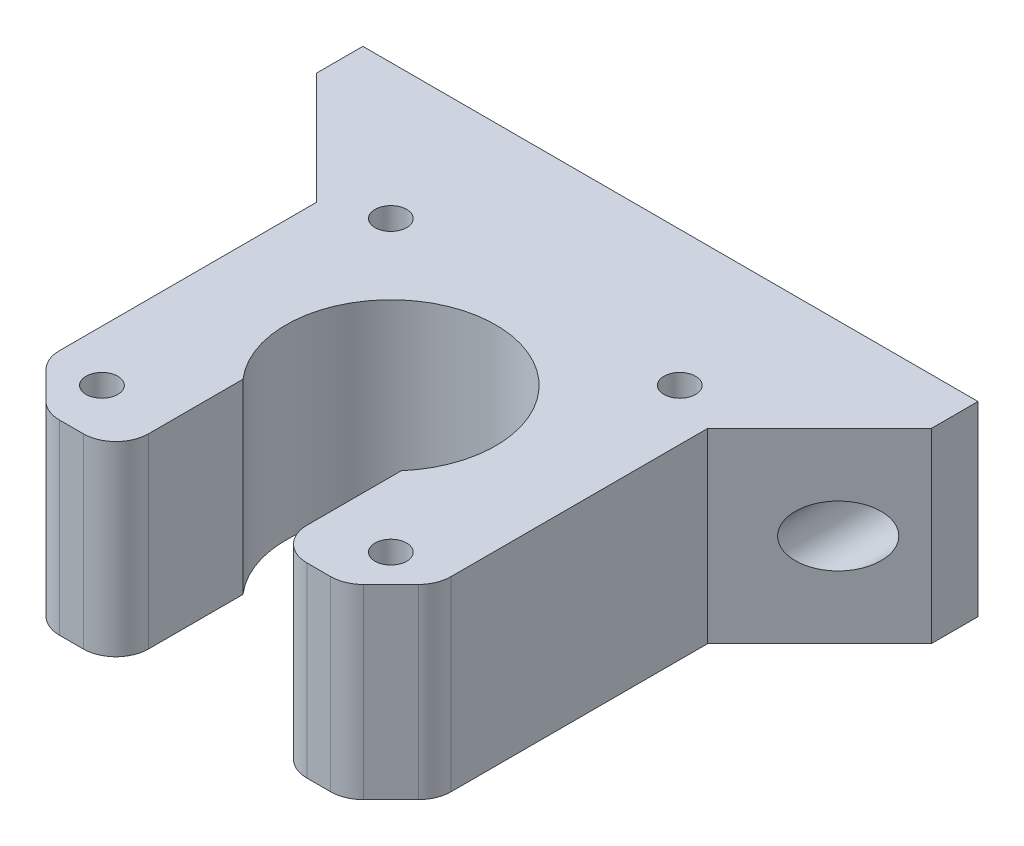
ISO-10303-21;
HEADER;
FILE_DESCRIPTION(('STEP AP214'),'2;1');
FILE_NAME('part.step','',(''),(''),'','','');
FILE_SCHEMA(('AUTOMOTIVE_DESIGN { 1 0 10303 214 1 1 1 1 }'));
ENDSEC;
DATA;
#1=APPLICATION_CONTEXT('core data for automotive mechanical design processes');
#2=APPLICATION_PROTOCOL_DEFINITION('international standard','automotive_design',2000,#1);
#3=PRODUCT_CONTEXT('',#1,'mechanical');
#4=PRODUCT('Part','Part','',(#3));
#5=PRODUCT_RELATED_PRODUCT_CATEGORY('part','',(#4));
#6=PRODUCT_DEFINITION_FORMATION('','',#4);
#7=PRODUCT_DEFINITION_CONTEXT('part definition',#1,'design');
#8=PRODUCT_DEFINITION('design','',#6,#7);
#9=PRODUCT_DEFINITION_SHAPE('','',#8);
#10=(LENGTH_UNIT() NAMED_UNIT(*) SI_UNIT(.MILLI.,.METRE.));
#11=(NAMED_UNIT(*) PLANE_ANGLE_UNIT() SI_UNIT($,.RADIAN.));
#12=(NAMED_UNIT(*) SI_UNIT($,.STERADIAN.) SOLID_ANGLE_UNIT());
#13=UNCERTAINTY_MEASURE_WITH_UNIT(LENGTH_MEASURE(1.E-05),#10,'distance_accuracy_value','');
#14=(GEOMETRIC_REPRESENTATION_CONTEXT(3) GLOBAL_UNCERTAINTY_ASSIGNED_CONTEXT((#13)) GLOBAL_UNIT_ASSIGNED_CONTEXT((#10,
#11,#12)) REPRESENTATION_CONTEXT('',''));
#15=CARTESIAN_POINT('',(0.,0.,0.));
#16=DIRECTION('',(0.,0.,1.));
#17=DIRECTION('',(1.,0.,0.));
#18=AXIS2_PLACEMENT_3D('',#15,#16,#17);
#19=CARTESIAN_POINT('',(21.,10.,21.));
#20=DIRECTION('',(-1.,0.,0.));
#21=DIRECTION('',(0.,0.,1.));
#22=AXIS2_PLACEMENT_3D('',#19,#20,#21);
#23=PLANE('',#22);
#24=DIRECTION('',(0.,0.,-1.));
#25=VECTOR('',#24,1.);
#26=CARTESIAN_POINT('',(21.,-10.,21.));
#27=LINE('',#26,#25);
#28=CARTESIAN_POINT('',(21.,-10.,14.5502525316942));
#29=VERTEX_POINT('',#28);
#30=CARTESIAN_POINT('',(21.,-10.,-12.9999999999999));
#31=VERTEX_POINT('',#30);
#32=EDGE_CURVE('E346',#29,#31,#27,.T.);
#33=ORIENTED_EDGE('',*,*,#32,.T.);
#34=DIRECTION('',(0.,1.,0.));
#35=VECTOR('',#34,1.);
#36=CARTESIAN_POINT('',(21.,-30.8086520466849,-12.9999999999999));
#37=LINE('',#36,#35);
#38=CARTESIAN_POINT('',(21.,10.,-12.9999999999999));
#39=VERTEX_POINT('',#38);
#40=EDGE_CURVE('E531',#31,#39,#37,.T.);
#41=ORIENTED_EDGE('',*,*,#40,.T.);
#42=DIRECTION('',(0.,0.,-1.));
#43=VECTOR('',#42,1.);
#44=CARTESIAN_POINT('',(21.,10.,21.));
#45=LINE('',#44,#43);
#46=CARTESIAN_POINT('',(21.,10.,14.5502525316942));
#47=VERTEX_POINT('',#46);
#48=EDGE_CURVE('E350',#47,#39,#45,.T.);
#49=ORIENTED_EDGE('',*,*,#48,.F.);
#50=DIRECTION('',(0.,1.,0.));
#51=VECTOR('',#50,1.);
#52=CARTESIAN_POINT('',(21.,-10.,14.5502525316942));
#53=LINE('',#52,#51);
#54=EDGE_CURVE('E448',#47,#29,#53,.F.);
#55=ORIENTED_EDGE('',*,*,#54,.T.);
#56=EDGE_LOOP('',(#33,#41,#49,#55));
#57=FACE_BOUND('',#56,.T.);
#58=ADVANCED_FACE('F46',(#57),#23,.F.);
#59=CARTESIAN_POINT('',(-21.,10.,21.));
#60=DIRECTION('',(0.,0.,-1.));
#61=DIRECTION('',(-1.,0.,0.));
#62=AXIS2_PLACEMENT_3D('',#59,#60,#61);
#63=PLANE('',#62);
#64=DIRECTION('',(1.,0.,0.));
#65=VECTOR('',#64,1.);
#66=CARTESIAN_POINT('',(-21.,-10.,21.));
#67=LINE('',#66,#65);
#68=CARTESIAN_POINT('',(-14.5502525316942,-10.,21.));
#69=VERTEX_POINT('',#68);
#70=CARTESIAN_POINT('',(-12.,-10.,21.));
#71=VERTEX_POINT('',#70);
#72=EDGE_CURVE('E355',#69,#71,#67,.T.);
#73=ORIENTED_EDGE('',*,*,#72,.T.);
#74=DIRECTION('',(0.,1.,0.));
#75=VECTOR('',#74,1.);
#76=CARTESIAN_POINT('',(-12.,10.,21.));
#77=LINE('',#76,#75);
#78=CARTESIAN_POINT('',(-12.,10.,21.));
#79=VERTEX_POINT('',#78);
#80=EDGE_CURVE('E441',#71,#79,#77,.T.);
#81=ORIENTED_EDGE('',*,*,#80,.T.);
#82=DIRECTION('',(1.,0.,0.));
#83=VECTOR('',#82,1.);
#84=CARTESIAN_POINT('',(-21.,10.,21.));
#85=LINE('',#84,#83);
#86=CARTESIAN_POINT('',(-14.5502525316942,10.,21.));
#87=VERTEX_POINT('',#86);
#88=EDGE_CURVE('E362',#87,#79,#85,.T.);
#89=ORIENTED_EDGE('',*,*,#88,.F.);
#90=DIRECTION('',(0.,1.,0.));
#91=VECTOR('',#90,1.);
#92=CARTESIAN_POINT('',(-14.5502525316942,-10.,21.));
#93=LINE('',#92,#91);
#94=EDGE_CURVE('E437',#87,#69,#93,.F.);
#95=ORIENTED_EDGE('',*,*,#94,.T.);
#96=EDGE_LOOP('',(#73,#81,#89,#95));
#97=FACE_BOUND('',#96,.T.);
#98=ADVANCED_FACE('F594',(#97),#63,.F.);
#99=CARTESIAN_POINT('',(-21.,10.,21.));
#100=DIRECTION('',(1.,0.,0.));
#101=DIRECTION('',(0.,0.,-1.));
#102=AXIS2_PLACEMENT_3D('',#99,#100,#101);
#103=PLANE('',#102);
#104=DIRECTION('',(0.,0.,1.));
#105=VECTOR('',#104,1.);
#106=CARTESIAN_POINT('',(-21.,10.,21.));
#107=LINE('',#106,#105);
#108=CARTESIAN_POINT('',(-21.,10.,-12.9999999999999));
#109=VERTEX_POINT('',#108);
#110=CARTESIAN_POINT('',(-21.,10.,14.5502525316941));
#111=VERTEX_POINT('',#110);
#112=EDGE_CURVE('E354',#109,#111,#107,.T.);
#113=ORIENTED_EDGE('',*,*,#112,.F.);
#114=DIRECTION('',(0.,1.,0.));
#115=VECTOR('',#114,1.);
#116=CARTESIAN_POINT('',(-21.,-30.8086520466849,-12.9999999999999));
#117=LINE('',#116,#115);
#118=CARTESIAN_POINT('',(-21.,-10.,-12.9999999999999));
#119=VERTEX_POINT('',#118);
#120=EDGE_CURVE('E249',#119,#109,#117,.T.);
#121=ORIENTED_EDGE('',*,*,#120,.F.);
#122=DIRECTION('',(0.,0.,1.));
#123=VECTOR('',#122,1.);
#124=CARTESIAN_POINT('',(-21.,-10.,21.));
#125=LINE('',#124,#123);
#126=CARTESIAN_POINT('',(-21.,-10.,14.5502525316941));
#127=VERTEX_POINT('',#126);
#128=EDGE_CURVE('E366',#119,#127,#125,.T.);
#129=ORIENTED_EDGE('',*,*,#128,.T.);
#130=DIRECTION('',(0.,-1.,0.));
#131=VECTOR('',#130,1.);
#132=CARTESIAN_POINT('',(-21.,10.,14.5502525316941));
#133=LINE('',#132,#131);
#134=EDGE_CURVE('E11',#127,#111,#133,.F.);
#135=ORIENTED_EDGE('',*,*,#134,.T.);
#136=EDGE_LOOP('',(#113,#121,#129,#135));
#137=FACE_BOUND('',#136,.T.);
#138=ADVANCED_FACE('F573',(#137),#103,.F.);
#139=CARTESIAN_POINT('',(12.,10.,21.));
#140=VERTEX_POINT('',#139);
#141=CARTESIAN_POINT('',(14.5502525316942,10.,21.));
#142=VERTEX_POINT('',#141);
#143=EDGE_CURVE('E358',#140,#142,#85,.T.);
#144=ORIENTED_EDGE('',*,*,#143,.F.);
#145=DIRECTION('',(0.,1.,0.));
#146=VECTOR('',#145,1.);
#147=CARTESIAN_POINT('',(12.,10.,21.));
#148=LINE('',#147,#146);
#149=CARTESIAN_POINT('',(12.,-10.,21.));
#150=VERTEX_POINT('',#149);
#151=EDGE_CURVE('E415',#140,#150,#148,.F.);
#152=ORIENTED_EDGE('',*,*,#151,.T.);
#153=CARTESIAN_POINT('',(14.5502525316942,-10.,21.));
#154=VERTEX_POINT('',#153);
#155=EDGE_CURVE('E369',#150,#154,#67,.T.);
#156=ORIENTED_EDGE('',*,*,#155,.T.);
#157=DIRECTION('',(0.,-1.,0.));
#158=VECTOR('',#157,1.);
#159=CARTESIAN_POINT('',(14.5502525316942,10.,21.));
#160=LINE('',#159,#158);
#161=EDGE_CURVE('E411',#154,#142,#160,.F.);
#162=ORIENTED_EDGE('',*,*,#161,.T.);
#163=EDGE_LOOP('',(#144,#152,#156,#162));
#164=FACE_BOUND('',#163,.T.);
#165=ADVANCED_FACE('F671',(#164),#63,.F.);
#166=CARTESIAN_POINT('',(0.,10.,0.));
#167=DIRECTION('',(0.,-1.,0.));
#168=DIRECTION('',(0.,0.,-1.));
#169=AXIS2_PLACEMENT_3D('',#166,#167,#168);
#170=PLANE('',#169);
#171=CARTESIAN_POINT('',(-15.5,10.,15.5));
#172=DIRECTION('',(0.,-1.,0.));
#173=DIRECTION('',(0.,0.,-1.));
#174=AXIS2_PLACEMENT_3D('',#171,#172,#173);
#175=CIRCLE('',#174,1.69999999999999);
#176=CARTESIAN_POINT('',(-15.5,10.,13.8));
#177=VERTEX_POINT('',#176);
#178=EDGE_CURVE('E268',#177,#177,#175,.T.);
#179=ORIENTED_EDGE('',*,*,#178,.T.);
#180=EDGE_LOOP('',(#179));
#181=FACE_BOUND('',#180,.T.);
#182=CARTESIAN_POINT('',(-15.5,10.,-15.5));
#183=DIRECTION('',(0.,-1.,0.));
#184=DIRECTION('',(0.,0.,-1.));
#185=AXIS2_PLACEMENT_3D('',#182,#183,#184);
#186=CIRCLE('',#185,1.69999999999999);
#187=CARTESIAN_POINT('',(-15.5,10.,-17.2));
#188=VERTEX_POINT('',#187);
#189=EDGE_CURVE('E284',#188,#188,#186,.T.);
#190=ORIENTED_EDGE('',*,*,#189,.T.);
#191=EDGE_LOOP('',(#190));
#192=FACE_BOUND('',#191,.T.);
#193=CARTESIAN_POINT('',(15.5,10.,-15.5));
#194=DIRECTION('',(0.,-1.,0.));
#195=DIRECTION('',(0.,0.,-1.));
#196=AXIS2_PLACEMENT_3D('',#193,#194,#195);
#197=CIRCLE('',#196,1.69999999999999);
#198=CARTESIAN_POINT('',(15.5,10.,-17.2));
#199=VERTEX_POINT('',#198);
#200=EDGE_CURVE('E300',#199,#199,#197,.T.);
#201=ORIENTED_EDGE('',*,*,#200,.T.);
#202=EDGE_LOOP('',(#201));
#203=FACE_BOUND('',#202,.T.);
#204=CARTESIAN_POINT('',(15.5,10.,15.5));
#205=DIRECTION('',(0.,-1.,0.));
#206=DIRECTION('',(0.,0.,-1.));
#207=AXIS2_PLACEMENT_3D('',#204,#205,#206);
#208=CIRCLE('',#207,1.69999999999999);
#209=CARTESIAN_POINT('',(15.5,10.,13.8));
#210=VERTEX_POINT('',#209);
#211=EDGE_CURVE('E316',#210,#210,#208,.T.);
#212=ORIENTED_EDGE('',*,*,#211,.T.);
#213=EDGE_LOOP('',(#212));
#214=FACE_BOUND('',#213,.T.);
#215=DIRECTION('',(0.,0.,-1.));
#216=VECTOR('',#215,1.);
#217=CARTESIAN_POINT('',(8.5,10.,21.));
#218=LINE('',#217,#216);
#219=CARTESIAN_POINT('',(8.5,10.,17.5));
#220=VERTEX_POINT('',#219);
#221=CARTESIAN_POINT('',(8.5,10.,7.36970148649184));
#222=VERTEX_POINT('',#221);
#223=EDGE_CURVE('E337',#220,#222,#218,.T.);
#224=ORIENTED_EDGE('',*,*,#223,.F.);
#225=CARTESIAN_POINT('',(12.,10.,17.5));
#226=DIRECTION('',(0.,-1.,0.));
#227=DIRECTION('',(0.,0.,-1.));
#228=AXIS2_PLACEMENT_3D('',#225,#226,#227);
#229=CIRCLE('',#228,3.5);
#230=EDGE_CURVE('E408',#220,#140,#229,.F.);
#231=ORIENTED_EDGE('',*,*,#230,.T.);
#232=ORIENTED_EDGE('',*,*,#143,.T.);
#233=CARTESIAN_POINT('',(14.5502525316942,10.,17.5));
#234=DIRECTION('',(0.,-1.,0.));
#235=DIRECTION('',(0.,0.,-1.));
#236=AXIS2_PLACEMENT_3D('',#233,#234,#235);
#237=CIRCLE('',#236,3.5);
#238=CARTESIAN_POINT('',(17.0251262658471,10.,19.9748737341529));
#239=VERTEX_POINT('',#238);
#240=EDGE_CURVE('E399',#142,#239,#237,.F.);
#241=ORIENTED_EDGE('',*,*,#240,.T.);
#242=DIRECTION('',(-0.707106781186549,0.,0.707106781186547));
#243=VECTOR('',#242,1.);
#244=CARTESIAN_POINT('',(21.,10.,16.));
#245=LINE('',#244,#243);
#246=CARTESIAN_POINT('',(19.9748737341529,10.,17.0251262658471));
#247=VERTEX_POINT('',#246);
#248=EDGE_CURVE('E381',#239,#247,#245,.F.);
#249=ORIENTED_EDGE('',*,*,#248,.T.);
#250=CARTESIAN_POINT('',(17.5,10.,14.5502525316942));
#251=DIRECTION('',(0.,-1.,0.));
#252=DIRECTION('',(0.,0.,-1.));
#253=AXIS2_PLACEMENT_3D('',#250,#251,#252);
#254=CIRCLE('',#253,3.5);
#255=EDGE_CURVE('E402',#247,#47,#254,.F.);
#256=ORIENTED_EDGE('',*,*,#255,.T.);
#257=ORIENTED_EDGE('',*,*,#48,.T.);
#258=DIRECTION('',(0.707106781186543,0.,-0.707106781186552));
#259=VECTOR('',#258,1.);
#260=CARTESIAN_POINT('',(33.,10.,-25.));
#261=LINE('',#260,#259);
#262=CARTESIAN_POINT('',(33.,10.,-25.));
#263=VERTEX_POINT('',#262);
#264=EDGE_CURVE('E467',#39,#263,#261,.T.);
#265=ORIENTED_EDGE('',*,*,#264,.T.);
#266=DIRECTION('',(0.,0.,-1.));
#267=VECTOR('',#266,1.);
#268=CARTESIAN_POINT('',(33.,10.,-30.));
#269=LINE('',#268,#267);
#270=CARTESIAN_POINT('',(33.,10.,-30.));
#271=VERTEX_POINT('',#270);
#272=EDGE_CURVE('E511',#263,#271,#269,.T.);
#273=ORIENTED_EDGE('',*,*,#272,.T.);
#274=DIRECTION('',(1.,0.,0.));
#275=VECTOR('',#274,1.);
#276=CARTESIAN_POINT('',(-21.,10.,-30.));
#277=LINE('',#276,#275);
#278=CARTESIAN_POINT('',(-33.,10.,-30.));
#279=VERTEX_POINT('',#278);
#280=EDGE_CURVE('E253',#279,#271,#277,.T.);
#281=ORIENTED_EDGE('',*,*,#280,.F.);
#282=DIRECTION('',(0.,0.,1.));
#283=VECTOR('',#282,1.);
#284=CARTESIAN_POINT('',(-33.,10.,-30.));
#285=LINE('',#284,#283);
#286=CARTESIAN_POINT('',(-33.,10.,-25.));
#287=VERTEX_POINT('',#286);
#288=EDGE_CURVE('E537',#279,#287,#285,.T.);
#289=ORIENTED_EDGE('',*,*,#288,.T.);
#290=DIRECTION('',(0.707106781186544,0.,0.707106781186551));
#291=VECTOR('',#290,1.);
#292=CARTESIAN_POINT('',(-33.,10.,-25.));
#293=LINE('',#292,#291);
#294=EDGE_CURVE('E538',#287,#109,#293,.T.);
#295=ORIENTED_EDGE('',*,*,#294,.T.);
#296=ORIENTED_EDGE('',*,*,#112,.T.);
#297=CARTESIAN_POINT('',(-17.5,10.,14.5502525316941));
#298=DIRECTION('',(0.,-1.,0.));
#299=DIRECTION('',(0.,0.,-1.));
#300=AXIS2_PLACEMENT_3D('',#297,#298,#299);
#301=CIRCLE('',#300,3.5);
#302=CARTESIAN_POINT('',(-19.9748737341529,10.,17.0251262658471));
#303=VERTEX_POINT('',#302);
#304=EDGE_CURVE('E393',#111,#303,#301,.F.);
#305=ORIENTED_EDGE('',*,*,#304,.T.);
#306=DIRECTION('',(-0.707106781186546,0.,-0.707106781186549));
#307=VECTOR('',#306,1.);
#308=CARTESIAN_POINT('',(-16.,10.,21.));
#309=LINE('',#308,#307);
#310=CARTESIAN_POINT('',(-17.0251262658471,10.,19.9748737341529));
#311=VERTEX_POINT('',#310);
#312=EDGE_CURVE('E385',#303,#311,#309,.F.);
#313=ORIENTED_EDGE('',*,*,#312,.T.);
#314=CARTESIAN_POINT('',(-14.5502525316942,10.,17.5));
#315=DIRECTION('',(0.,-1.,0.));
#316=DIRECTION('',(0.,0.,-1.));
#317=AXIS2_PLACEMENT_3D('',#314,#315,#316);
#318=CIRCLE('',#317,3.5);
#319=EDGE_CURVE('E396',#311,#87,#318,.F.);
#320=ORIENTED_EDGE('',*,*,#319,.T.);
#321=ORIENTED_EDGE('',*,*,#88,.T.);
#322=CARTESIAN_POINT('',(-12.,10.,17.5));
#323=DIRECTION('',(0.,-1.,0.));
#324=DIRECTION('',(0.,0.,-1.));
#325=AXIS2_PLACEMENT_3D('',#322,#323,#324);
#326=CIRCLE('',#325,3.5);
#327=CARTESIAN_POINT('',(-8.5,10.,17.5));
#328=VERTEX_POINT('',#327);
#329=EDGE_CURVE('E405',#79,#328,#326,.F.);
#330=ORIENTED_EDGE('',*,*,#329,.T.);
#331=DIRECTION('',(0.,0.,1.));
#332=VECTOR('',#331,1.);
#333=CARTESIAN_POINT('',(-8.5,10.,21.));
#334=LINE('',#333,#332);
#335=CARTESIAN_POINT('',(-8.5,10.,7.36970148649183));
#336=VERTEX_POINT('',#335);
#337=EDGE_CURVE('E320',#336,#328,#334,.T.);
#338=ORIENTED_EDGE('',*,*,#337,.F.);
#339=CARTESIAN_POINT('',(0.,10.,0.));
#340=DIRECTION('',(0.,1.,0.));
#341=DIRECTION('',(0.,0.,1.));
#342=AXIS2_PLACEMENT_3D('',#339,#340,#341);
#343=CIRCLE('',#342,11.25);
#344=EDGE_CURVE('E326',#222,#336,#343,.T.);
#345=ORIENTED_EDGE('',*,*,#344,.F.);
#346=EDGE_LOOP('',(#224,#231,#232,#241,#249,#256,#257,#265,#273,#281,#289,#295,#296,#305,#313,
#320,#321,#330,#338,#345));
#347=FACE_BOUND('',#346,.T.);
#348=ADVANCED_FACE('F566',(#181,#192,#203,#214,#347),#170,.F.);
#349=CARTESIAN_POINT('',(0.,-10.,0.));
#350=DIRECTION('',(0.,-1.,0.));
#351=DIRECTION('',(0.,0.,-1.));
#352=AXIS2_PLACEMENT_3D('',#349,#350,#351);
#353=PLANE('',#352);
#354=CARTESIAN_POINT('',(-15.5,-10.,15.5));
#355=DIRECTION('',(0.,-1.,0.));
#356=DIRECTION('',(0.,0.,-1.));
#357=AXIS2_PLACEMENT_3D('',#354,#355,#356);
#358=CIRCLE('',#357,3.25);
#359=CARTESIAN_POINT('',(-15.5,-10.,12.25));
#360=VERTEX_POINT('',#359);
#361=EDGE_CURVE('E256',#360,#360,#358,.T.);
#362=ORIENTED_EDGE('',*,*,#361,.F.);
#363=EDGE_LOOP('',(#362));
#364=FACE_BOUND('',#363,.T.);
#365=CARTESIAN_POINT('',(-15.5,-10.,-15.5));
#366=DIRECTION('',(0.,-1.,0.));
#367=DIRECTION('',(0.,0.,-1.));
#368=AXIS2_PLACEMENT_3D('',#365,#366,#367);
#369=CIRCLE('',#368,3.25);
#370=CARTESIAN_POINT('',(-15.5,-10.,-18.75));
#371=VERTEX_POINT('',#370);
#372=EDGE_CURVE('E272',#371,#371,#369,.T.);
#373=ORIENTED_EDGE('',*,*,#372,.F.);
#374=EDGE_LOOP('',(#373));
#375=FACE_BOUND('',#374,.T.);
#376=CARTESIAN_POINT('',(15.5,-10.,-15.5));
#377=DIRECTION('',(0.,-1.,0.));
#378=DIRECTION('',(0.,0.,-1.));
#379=AXIS2_PLACEMENT_3D('',#376,#377,#378);
#380=CIRCLE('',#379,3.25);
#381=CARTESIAN_POINT('',(15.5,-10.,-18.75));
#382=VERTEX_POINT('',#381);
#383=EDGE_CURVE('E288',#382,#382,#380,.T.);
#384=ORIENTED_EDGE('',*,*,#383,.F.);
#385=EDGE_LOOP('',(#384));
#386=FACE_BOUND('',#385,.T.);
#387=CARTESIAN_POINT('',(15.5,-10.,15.5));
#388=DIRECTION('',(0.,-1.,0.));
#389=DIRECTION('',(0.,0.,-1.));
#390=AXIS2_PLACEMENT_3D('',#387,#388,#389);
#391=CIRCLE('',#390,3.25);
#392=CARTESIAN_POINT('',(15.5,-10.,12.25));
#393=VERTEX_POINT('',#392);
#394=EDGE_CURVE('E304',#393,#393,#391,.T.);
#395=ORIENTED_EDGE('',*,*,#394,.F.);
#396=EDGE_LOOP('',(#395));
#397=FACE_BOUND('',#396,.T.);
#398=ORIENTED_EDGE('',*,*,#155,.F.);
#399=CARTESIAN_POINT('',(12.,-10.,17.5));
#400=DIRECTION('',(0.,-1.,0.));
#401=DIRECTION('',(0.,0.,-1.));
#402=AXIS2_PLACEMENT_3D('',#399,#400,#401);
#403=CIRCLE('',#402,3.5);
#404=CARTESIAN_POINT('',(8.5,-10.,17.5));
#405=VERTEX_POINT('',#404);
#406=EDGE_CURVE('E434',#150,#405,#403,.T.);
#407=ORIENTED_EDGE('',*,*,#406,.T.);
#408=DIRECTION('',(0.,0.,-1.));
#409=VECTOR('',#408,1.);
#410=CARTESIAN_POINT('',(8.5,-10.,21.));
#411=LINE('',#410,#409);
#412=CARTESIAN_POINT('',(8.5,-10.,7.36970148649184));
#413=VERTEX_POINT('',#412);
#414=EDGE_CURVE('E325',#405,#413,#411,.T.);
#415=ORIENTED_EDGE('',*,*,#414,.T.);
#416=CARTESIAN_POINT('',(0.,-10.,0.));
#417=DIRECTION('',(0.,1.,0.));
#418=DIRECTION('',(0.,0.,1.));
#419=AXIS2_PLACEMENT_3D('',#416,#417,#418);
#420=CIRCLE('',#419,11.25);
#421=CARTESIAN_POINT('',(-8.5,-10.,7.36970148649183));
#422=VERTEX_POINT('',#421);
#423=EDGE_CURVE('E329',#413,#422,#420,.T.);
#424=ORIENTED_EDGE('',*,*,#423,.T.);
#425=DIRECTION('',(0.,0.,1.));
#426=VECTOR('',#425,1.);
#427=CARTESIAN_POINT('',(-8.5,-10.,21.));
#428=LINE('',#427,#426);
#429=CARTESIAN_POINT('',(-8.5,-10.,17.5));
#430=VERTEX_POINT('',#429);
#431=EDGE_CURVE('E321',#422,#430,#428,.T.);
#432=ORIENTED_EDGE('',*,*,#431,.T.);
#433=CARTESIAN_POINT('',(-12.,-10.,17.5));
#434=DIRECTION('',(0.,-1.,0.));
#435=DIRECTION('',(0.,0.,-1.));
#436=AXIS2_PLACEMENT_3D('',#433,#434,#435);
#437=CIRCLE('',#436,3.5);
#438=EDGE_CURVE('E431',#430,#71,#437,.T.);
#439=ORIENTED_EDGE('',*,*,#438,.T.);
#440=ORIENTED_EDGE('',*,*,#72,.F.);
#441=CARTESIAN_POINT('',(-14.5502525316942,-10.,17.5));
#442=DIRECTION('',(0.,-1.,0.));
#443=DIRECTION('',(0.,0.,-1.));
#444=AXIS2_PLACEMENT_3D('',#441,#442,#443);
#445=CIRCLE('',#444,3.5);
#446=CARTESIAN_POINT('',(-17.0251262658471,-10.,19.9748737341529));
#447=VERTEX_POINT('',#446);
#448=EDGE_CURVE('E422',#69,#447,#445,.T.);
#449=ORIENTED_EDGE('',*,*,#448,.T.);
#450=DIRECTION('',(0.707106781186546,0.,0.707106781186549));
#451=VECTOR('',#450,1.);
#452=CARTESIAN_POINT('',(-18.5,-10.,18.5));
#453=LINE('',#452,#451);
#454=CARTESIAN_POINT('',(-19.9748737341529,-10.,17.0251262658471));
#455=VERTEX_POINT('',#454);
#456=EDGE_CURVE('E377',#447,#455,#453,.F.);
#457=ORIENTED_EDGE('',*,*,#456,.T.);
#458=CARTESIAN_POINT('',(-17.5,-10.,14.5502525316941));
#459=DIRECTION('',(0.,-1.,0.));
#460=DIRECTION('',(0.,0.,-1.));
#461=AXIS2_PLACEMENT_3D('',#458,#459,#460);
#462=CIRCLE('',#461,3.5);
#463=EDGE_CURVE('E418',#455,#127,#462,.T.);
#464=ORIENTED_EDGE('',*,*,#463,.T.);
#465=ORIENTED_EDGE('',*,*,#128,.F.);
#466=DIRECTION('',(0.707106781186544,0.,0.707106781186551));
#467=VECTOR('',#466,1.);
#468=CARTESIAN_POINT('',(-33.,-10.,-25.));
#469=LINE('',#468,#467);
#470=CARTESIAN_POINT('',(-33.,-10.,-25.));
#471=VERTEX_POINT('',#470);
#472=EDGE_CURVE('E545',#471,#119,#469,.T.);
#473=ORIENTED_EDGE('',*,*,#472,.F.);
#474=DIRECTION('',(0.,0.,1.));
#475=VECTOR('',#474,1.);
#476=CARTESIAN_POINT('',(-33.,-10.,-30.));
#477=LINE('',#476,#475);
#478=CARTESIAN_POINT('',(-33.,-10.,-30.));
#479=VERTEX_POINT('',#478);
#480=EDGE_CURVE('E549',#479,#471,#477,.T.);
#481=ORIENTED_EDGE('',*,*,#480,.F.);
#482=DIRECTION('',(-1.,0.,0.));
#483=VECTOR('',#482,1.);
#484=CARTESIAN_POINT('',(21.,-10.,-30.));
#485=LINE('',#484,#483);
#486=CARTESIAN_POINT('',(33.,-10.,-30.));
#487=VERTEX_POINT('',#486);
#488=EDGE_CURVE('E240',#487,#479,#485,.T.);
#489=ORIENTED_EDGE('',*,*,#488,.F.);
#490=DIRECTION('',(0.,0.,-1.));
#491=VECTOR('',#490,1.);
#492=CARTESIAN_POINT('',(33.,-10.,-30.));
#493=LINE('',#492,#491);
#494=CARTESIAN_POINT('',(33.,-10.,-25.));
#495=VERTEX_POINT('',#494);
#496=EDGE_CURVE('E523',#495,#487,#493,.T.);
#497=ORIENTED_EDGE('',*,*,#496,.F.);
#498=DIRECTION('',(0.707106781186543,0.,-0.707106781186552));
#499=VECTOR('',#498,1.);
#500=CARTESIAN_POINT('',(33.,-10.,-25.));
#501=LINE('',#500,#499);
#502=EDGE_CURVE('E515',#31,#495,#501,.T.);
#503=ORIENTED_EDGE('',*,*,#502,.F.);
#504=ORIENTED_EDGE('',*,*,#32,.F.);
#505=CARTESIAN_POINT('',(17.5,-10.,14.5502525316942));
#506=DIRECTION('',(0.,-1.,0.));
#507=DIRECTION('',(0.,0.,-1.));
#508=AXIS2_PLACEMENT_3D('',#505,#506,#507);
#509=CIRCLE('',#508,3.5);
#510=CARTESIAN_POINT('',(19.9748737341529,-10.,17.0251262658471));
#511=VERTEX_POINT('',#510);
#512=EDGE_CURVE('E428',#29,#511,#509,.T.);
#513=ORIENTED_EDGE('',*,*,#512,.T.);
#514=DIRECTION('',(0.707106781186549,0.,-0.707106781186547));
#515=VECTOR('',#514,1.);
#516=CARTESIAN_POINT('',(18.5,-10.,18.5));
#517=LINE('',#516,#515);
#518=CARTESIAN_POINT('',(17.0251262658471,-10.,19.9748737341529));
#519=VERTEX_POINT('',#518);
#520=EDGE_CURVE('E373',#511,#519,#517,.F.);
#521=ORIENTED_EDGE('',*,*,#520,.T.);
#522=CARTESIAN_POINT('',(14.5502525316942,-10.,17.5));
#523=DIRECTION('',(0.,-1.,0.));
#524=DIRECTION('',(0.,0.,-1.));
#525=AXIS2_PLACEMENT_3D('',#522,#523,#524);
#526=CIRCLE('',#525,3.5);
#527=EDGE_CURVE('E425',#519,#154,#526,.T.);
#528=ORIENTED_EDGE('',*,*,#527,.T.);
#529=EDGE_LOOP('',(#398,#407,#415,#424,#432,#439,#440,#449,#457,#464,#465,#473,#481,#489,#497,
#503,#504,#513,#521,#528));
#530=FACE_BOUND('',#529,.T.);
#531=ADVANCED_FACE('F576',(#364,#375,#386,#397,#530),#353,.T.);
#532=CARTESIAN_POINT('',(-8.5,-10.,21.));
#533=DIRECTION('',(-1.,0.,0.));
#534=DIRECTION('',(0.,0.,1.));
#535=AXIS2_PLACEMENT_3D('',#532,#533,#534);
#536=PLANE('',#535);
#537=ORIENTED_EDGE('',*,*,#337,.T.);
#538=DIRECTION('',(0.,1.,0.));
#539=VECTOR('',#538,1.);
#540=CARTESIAN_POINT('',(-8.5,-10.,17.5));
#541=LINE('',#540,#539);
#542=EDGE_CURVE('E445',#328,#430,#541,.F.);
#543=ORIENTED_EDGE('',*,*,#542,.T.);
#544=ORIENTED_EDGE('',*,*,#431,.F.);
#545=DIRECTION('',(0.,1.,0.));
#546=VECTOR('',#545,1.);
#547=CARTESIAN_POINT('',(-8.5,-10.,7.36970148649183));
#548=LINE('',#547,#546);
#549=EDGE_CURVE('E343',#422,#336,#548,.T.);
#550=ORIENTED_EDGE('',*,*,#549,.T.);
#551=EDGE_LOOP('',(#537,#543,#544,#550));
#552=FACE_BOUND('',#551,.T.);
#553=ADVANCED_FACE('F935',(#552),#536,.F.);
#554=CARTESIAN_POINT('',(0.,-10.,0.));
#555=DIRECTION('',(0.,1.,0.));
#556=DIRECTION('',(0.,0.,1.));
#557=AXIS2_PLACEMENT_3D('',#554,#555,#556);
#558=CYLINDRICAL_SURFACE('',#557,11.25);
#559=ORIENTED_EDGE('',*,*,#344,.T.);
#560=ORIENTED_EDGE('',*,*,#549,.F.);
#561=ORIENTED_EDGE('',*,*,#423,.F.);
#562=DIRECTION('',(0.,1.,0.));
#563=VECTOR('',#562,1.);
#564=CARTESIAN_POINT('',(8.5,-10.,7.36970148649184));
#565=LINE('',#564,#563);
#566=EDGE_CURVE('E333',#413,#222,#565,.T.);
#567=ORIENTED_EDGE('',*,*,#566,.T.);
#568=EDGE_LOOP('',(#559,#560,#561,#567));
#569=FACE_BOUND('',#568,.T.);
#570=ADVANCED_FACE('F1038',(#569),#558,.F.);
#571=CARTESIAN_POINT('',(8.5,-10.,21.));
#572=DIRECTION('',(1.,0.,0.));
#573=DIRECTION('',(0.,0.,-1.));
#574=AXIS2_PLACEMENT_3D('',#571,#572,#573);
#575=PLANE('',#574);
#576=ORIENTED_EDGE('',*,*,#414,.F.);
#577=DIRECTION('',(0.,1.,0.));
#578=VECTOR('',#577,1.);
#579=CARTESIAN_POINT('',(8.5,-10.,17.5));
#580=LINE('',#579,#578);
#581=EDGE_CURVE('E389',#405,#220,#580,.T.);
#582=ORIENTED_EDGE('',*,*,#581,.T.);
#583=ORIENTED_EDGE('',*,*,#223,.T.);
#584=ORIENTED_EDGE('',*,*,#566,.F.);
#585=EDGE_LOOP('',(#576,#582,#583,#584));
#586=FACE_BOUND('',#585,.T.);
#587=ADVANCED_FACE('F1031',(#586),#575,.F.);
#588=CARTESIAN_POINT('',(15.5,-10.,15.5));
#589=DIRECTION('',(0.,-1.,0.));
#590=DIRECTION('',(0.,0.,-1.));
#591=AXIS2_PLACEMENT_3D('',#588,#589,#590);
#592=CYLINDRICAL_SURFACE('',#591,1.7);
#593=ORIENTED_EDGE('',*,*,#211,.F.);
#594=EDGE_LOOP('',(#593));
#595=FACE_BOUND('',#594,.T.);
#596=CARTESIAN_POINT('',(15.5,-6.6,15.5));
#597=DIRECTION('',(0.,-1.,0.));
#598=DIRECTION('',(0.,0.,-1.));
#599=AXIS2_PLACEMENT_3D('',#596,#597,#598);
#600=CIRCLE('',#599,1.7);
#601=CARTESIAN_POINT('',(15.5,-6.6,13.8));
#602=VERTEX_POINT('',#601);
#603=EDGE_CURVE('E312',#602,#602,#600,.T.);
#604=ORIENTED_EDGE('',*,*,#603,.T.);
#605=EDGE_LOOP('',(#604));
#606=FACE_BOUND('',#605,.T.);
#607=ADVANCED_FACE('F1037',(#595,#606),#592,.F.);
#608=CARTESIAN_POINT('',(17.2,-6.6,15.5));
#609=DIRECTION('',(0.,1.,0.));
#610=DIRECTION('',(0.,0.,1.));
#611=AXIS2_PLACEMENT_3D('',#608,#609,#610);
#612=PLANE('',#611);
#613=ORIENTED_EDGE('',*,*,#603,.F.);
#614=EDGE_LOOP('',(#613));
#615=FACE_BOUND('',#614,.T.);
#616=CARTESIAN_POINT('',(15.5,-6.6,15.5));
#617=DIRECTION('',(0.,-1.,0.));
#618=DIRECTION('',(0.,0.,-1.));
#619=AXIS2_PLACEMENT_3D('',#616,#617,#618);
#620=CIRCLE('',#619,3.25);
#621=CARTESIAN_POINT('',(15.5,-6.6,12.25));
#622=VERTEX_POINT('',#621);
#623=EDGE_CURVE('E308',#622,#622,#620,.T.);
#624=ORIENTED_EDGE('',*,*,#623,.T.);
#625=EDGE_LOOP('',(#624));
#626=FACE_BOUND('',#625,.T.);
#627=ADVANCED_FACE('F1173',(#615,#626),#612,.F.);
#628=CARTESIAN_POINT('',(15.5,-10.,15.5));
#629=DIRECTION('',(0.,-1.,0.));
#630=DIRECTION('',(0.,0.,-1.));
#631=AXIS2_PLACEMENT_3D('',#628,#629,#630);
#632=CYLINDRICAL_SURFACE('',#631,3.25);
#633=ORIENTED_EDGE('',*,*,#623,.F.);
#634=EDGE_LOOP('',(#633));
#635=FACE_BOUND('',#634,.T.);
#636=ORIENTED_EDGE('',*,*,#394,.T.);
#637=EDGE_LOOP('',(#636));
#638=FACE_BOUND('',#637,.T.);
#639=ADVANCED_FACE('F1162',(#635,#638),#632,.F.);
#640=CARTESIAN_POINT('',(15.5,-10.,-15.5));
#641=DIRECTION('',(0.,-1.,0.));
#642=DIRECTION('',(0.,0.,-1.));
#643=AXIS2_PLACEMENT_3D('',#640,#641,#642);
#644=CYLINDRICAL_SURFACE('',#643,1.7);
#645=ORIENTED_EDGE('',*,*,#200,.F.);
#646=EDGE_LOOP('',(#645));
#647=FACE_BOUND('',#646,.T.);
#648=CARTESIAN_POINT('',(15.5,-6.6,-15.5));
#649=DIRECTION('',(0.,-1.,0.));
#650=DIRECTION('',(0.,0.,-1.));
#651=AXIS2_PLACEMENT_3D('',#648,#649,#650);
#652=CIRCLE('',#651,1.7);
#653=CARTESIAN_POINT('',(15.5,-6.6,-17.2));
#654=VERTEX_POINT('',#653);
#655=EDGE_CURVE('E296',#654,#654,#652,.T.);
#656=ORIENTED_EDGE('',*,*,#655,.T.);
#657=EDGE_LOOP('',(#656));
#658=FACE_BOUND('',#657,.T.);
#659=ADVANCED_FACE('F1151',(#647,#658),#644,.F.);
#660=CARTESIAN_POINT('',(17.2,-6.6,-15.5));
#661=DIRECTION('',(0.,1.,0.));
#662=DIRECTION('',(0.,0.,1.));
#663=AXIS2_PLACEMENT_3D('',#660,#661,#662);
#664=PLANE('',#663);
#665=ORIENTED_EDGE('',*,*,#655,.F.);
#666=EDGE_LOOP('',(#665));
#667=FACE_BOUND('',#666,.T.);
#668=CARTESIAN_POINT('',(15.5,-6.6,-15.5));
#669=DIRECTION('',(0.,-1.,0.));
#670=DIRECTION('',(0.,0.,-1.));
#671=AXIS2_PLACEMENT_3D('',#668,#669,#670);
#672=CIRCLE('',#671,3.25);
#673=CARTESIAN_POINT('',(15.5,-6.6,-18.75));
#674=VERTEX_POINT('',#673);
#675=EDGE_CURVE('E292',#674,#674,#672,.T.);
#676=ORIENTED_EDGE('',*,*,#675,.T.);
#677=EDGE_LOOP('',(#676));
#678=FACE_BOUND('',#677,.T.);
#679=ADVANCED_FACE('F1140',(#667,#678),#664,.F.);
#680=CARTESIAN_POINT('',(15.5,-10.,-15.5));
#681=DIRECTION('',(0.,-1.,0.));
#682=DIRECTION('',(0.,0.,-1.));
#683=AXIS2_PLACEMENT_3D('',#680,#681,#682);
#684=CYLINDRICAL_SURFACE('',#683,3.25);
#685=ORIENTED_EDGE('',*,*,#675,.F.);
#686=EDGE_LOOP('',(#685));
#687=FACE_BOUND('',#686,.T.);
#688=ORIENTED_EDGE('',*,*,#383,.T.);
#689=EDGE_LOOP('',(#688));
#690=FACE_BOUND('',#689,.T.);
#691=ADVANCED_FACE('F1129',(#687,#690),#684,.F.);
#692=CARTESIAN_POINT('',(-15.5,-10.,-15.5));
#693=DIRECTION('',(0.,-1.,0.));
#694=DIRECTION('',(0.,0.,-1.));
#695=AXIS2_PLACEMENT_3D('',#692,#693,#694);
#696=CYLINDRICAL_SURFACE('',#695,1.7);
#697=ORIENTED_EDGE('',*,*,#189,.F.);
#698=EDGE_LOOP('',(#697));
#699=FACE_BOUND('',#698,.T.);
#700=CARTESIAN_POINT('',(-15.5,-6.6,-15.5));
#701=DIRECTION('',(0.,-1.,0.));
#702=DIRECTION('',(0.,0.,-1.));
#703=AXIS2_PLACEMENT_3D('',#700,#701,#702);
#704=CIRCLE('',#703,1.7);
#705=CARTESIAN_POINT('',(-15.5,-6.6,-17.2));
#706=VERTEX_POINT('',#705);
#707=EDGE_CURVE('E280',#706,#706,#704,.T.);
#708=ORIENTED_EDGE('',*,*,#707,.T.);
#709=EDGE_LOOP('',(#708));
#710=FACE_BOUND('',#709,.T.);
#711=ADVANCED_FACE('F1118',(#699,#710),#696,.F.);
#712=CARTESIAN_POINT('',(-13.8,-6.6,-15.5));
#713=DIRECTION('',(0.,1.,0.));
#714=DIRECTION('',(0.,0.,1.));
#715=AXIS2_PLACEMENT_3D('',#712,#713,#714);
#716=PLANE('',#715);
#717=ORIENTED_EDGE('',*,*,#707,.F.);
#718=EDGE_LOOP('',(#717));
#719=FACE_BOUND('',#718,.T.);
#720=CARTESIAN_POINT('',(-15.5,-6.6,-15.5));
#721=DIRECTION('',(0.,-1.,0.));
#722=DIRECTION('',(0.,0.,-1.));
#723=AXIS2_PLACEMENT_3D('',#720,#721,#722);
#724=CIRCLE('',#723,3.25);
#725=CARTESIAN_POINT('',(-15.5,-6.6,-18.75));
#726=VERTEX_POINT('',#725);
#727=EDGE_CURVE('E276',#726,#726,#724,.T.);
#728=ORIENTED_EDGE('',*,*,#727,.T.);
#729=EDGE_LOOP('',(#728));
#730=FACE_BOUND('',#729,.T.);
#731=ADVANCED_FACE('F1107',(#719,#730),#716,.F.);
#732=CARTESIAN_POINT('',(-15.5,-10.,-15.5));
#733=DIRECTION('',(0.,-1.,0.));
#734=DIRECTION('',(0.,0.,-1.));
#735=AXIS2_PLACEMENT_3D('',#732,#733,#734);
#736=CYLINDRICAL_SURFACE('',#735,3.25);
#737=ORIENTED_EDGE('',*,*,#727,.F.);
#738=EDGE_LOOP('',(#737));
#739=FACE_BOUND('',#738,.T.);
#740=ORIENTED_EDGE('',*,*,#372,.T.);
#741=EDGE_LOOP('',(#740));
#742=FACE_BOUND('',#741,.T.);
#743=ADVANCED_FACE('F1096',(#739,#742),#736,.F.);
#744=CARTESIAN_POINT('',(-15.5,-10.,15.5));
#745=DIRECTION('',(0.,-1.,0.));
#746=DIRECTION('',(0.,0.,-1.));
#747=AXIS2_PLACEMENT_3D('',#744,#745,#746);
#748=CYLINDRICAL_SURFACE('',#747,1.7);
#749=ORIENTED_EDGE('',*,*,#178,.F.);
#750=EDGE_LOOP('',(#749));
#751=FACE_BOUND('',#750,.T.);
#752=CARTESIAN_POINT('',(-15.5,-6.6,15.5));
#753=DIRECTION('',(0.,-1.,0.));
#754=DIRECTION('',(0.,0.,-1.));
#755=AXIS2_PLACEMENT_3D('',#752,#753,#754);
#756=CIRCLE('',#755,1.7);
#757=CARTESIAN_POINT('',(-15.5,-6.6,13.8));
#758=VERTEX_POINT('',#757);
#759=EDGE_CURVE('E264',#758,#758,#756,.T.);
#760=ORIENTED_EDGE('',*,*,#759,.T.);
#761=EDGE_LOOP('',(#760));
#762=FACE_BOUND('',#761,.T.);
#763=ADVANCED_FACE('F1085',(#751,#762),#748,.F.);
#764=CARTESIAN_POINT('',(-13.8,-6.6,15.5));
#765=DIRECTION('',(0.,1.,0.));
#766=DIRECTION('',(0.,0.,1.));
#767=AXIS2_PLACEMENT_3D('',#764,#765,#766);
#768=PLANE('',#767);
#769=ORIENTED_EDGE('',*,*,#759,.F.);
#770=EDGE_LOOP('',(#769));
#771=FACE_BOUND('',#770,.T.);
#772=CARTESIAN_POINT('',(-15.5,-6.6,15.5));
#773=DIRECTION('',(0.,-1.,0.));
#774=DIRECTION('',(0.,0.,-1.));
#775=AXIS2_PLACEMENT_3D('',#772,#773,#774);
#776=CIRCLE('',#775,3.25);
#777=CARTESIAN_POINT('',(-15.5,-6.6,12.25));
#778=VERTEX_POINT('',#777);
#779=EDGE_CURVE('E260',#778,#778,#776,.T.);
#780=ORIENTED_EDGE('',*,*,#779,.T.);
#781=EDGE_LOOP('',(#780));
#782=FACE_BOUND('',#781,.T.);
#783=ADVANCED_FACE('F729',(#771,#782),#768,.F.);
#784=CARTESIAN_POINT('',(-15.5,-10.,15.5));
#785=DIRECTION('',(0.,-1.,0.));
#786=DIRECTION('',(0.,0.,-1.));
#787=AXIS2_PLACEMENT_3D('',#784,#785,#786);
#788=CYLINDRICAL_SURFACE('',#787,3.25);
#789=ORIENTED_EDGE('',*,*,#779,.F.);
#790=EDGE_LOOP('',(#789));
#791=FACE_BOUND('',#790,.T.);
#792=ORIENTED_EDGE('',*,*,#361,.T.);
#793=EDGE_LOOP('',(#792));
#794=FACE_BOUND('',#793,.T.);
#795=ADVANCED_FACE('F720',(#791,#794),#788,.F.);
#796=CARTESIAN_POINT('',(0.,0.,-30.));
#797=DIRECTION('',(0.,0.,-1.));
#798=DIRECTION('',(-1.,0.,0.));
#799=AXIS2_PLACEMENT_3D('',#796,#797,#798);
#800=PLANE('',#799);
#801=DIRECTION('',(0.,-1.,0.));
#802=VECTOR('',#801,1.);
#803=CARTESIAN_POINT('',(18.,2.4,-30.));
#804=LINE('',#803,#802);
#805=CARTESIAN_POINT('',(18.,2.4,-30.));
#806=VERTEX_POINT('',#805);
#807=CARTESIAN_POINT('',(18.,-2.4,-30.));
#808=VERTEX_POINT('',#807);
#809=EDGE_CURVE('E229',#806,#808,#804,.T.);
#810=ORIENTED_EDGE('',*,*,#809,.F.);
#811=DIRECTION('',(1.,0.,0.));
#812=VECTOR('',#811,1.);
#813=CARTESIAN_POINT('',(21.,2.4,-30.));
#814=LINE('',#813,#812);
#815=CARTESIAN_POINT('',(-18.,2.4,-30.));
#816=VERTEX_POINT('',#815);
#817=EDGE_CURVE('E227',#816,#806,#814,.T.);
#818=ORIENTED_EDGE('',*,*,#817,.F.);
#819=DIRECTION('',(0.,1.,0.));
#820=VECTOR('',#819,1.);
#821=CARTESIAN_POINT('',(-18.,2.4,-30.));
#822=LINE('',#821,#820);
#823=CARTESIAN_POINT('',(-18.,-2.4,-30.));
#824=VERTEX_POINT('',#823);
#825=EDGE_CURVE('E220',#824,#816,#822,.T.);
#826=ORIENTED_EDGE('',*,*,#825,.F.);
#827=DIRECTION('',(-1.,0.,0.));
#828=VECTOR('',#827,1.);
#829=CARTESIAN_POINT('',(21.,-2.4,-30.));
#830=LINE('',#829,#828);
#831=EDGE_CURVE('E235',#808,#824,#830,.T.);
#832=ORIENTED_EDGE('',*,*,#831,.F.);
#833=EDGE_LOOP('',(#810,#818,#826,#832));
#834=FACE_BOUND('',#833,.T.);
#835=CARTESIAN_POINT('',(-28.,0.,-30.));
#836=DIRECTION('',(0.,0.,-1.));
#837=DIRECTION('',(-1.,0.,0.));
#838=AXIS2_PLACEMENT_3D('',#835,#836,#837);
#839=CIRCLE('',#838,1.70000000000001);
#840=CARTESIAN_POINT('',(-29.7,0.,-30.));
#841=VERTEX_POINT('',#840);
#842=EDGE_CURVE('E469',#841,#841,#839,.T.);
#843=ORIENTED_EDGE('',*,*,#842,.F.);
#844=EDGE_LOOP('',(#843));
#845=FACE_BOUND('',#844,.T.);
#846=CARTESIAN_POINT('',(28.,0.,-30.));
#847=DIRECTION('',(0.,0.,-1.));
#848=DIRECTION('',(-1.,0.,0.));
#849=AXIS2_PLACEMENT_3D('',#846,#847,#848);
#850=CIRCLE('',#849,1.70000000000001);
#851=CARTESIAN_POINT('',(26.3,0.,-30.));
#852=VERTEX_POINT('',#851);
#853=EDGE_CURVE('E463',#852,#852,#850,.T.);
#854=ORIENTED_EDGE('',*,*,#853,.F.);
#855=EDGE_LOOP('',(#854));
#856=FACE_BOUND('',#855,.T.);
#857=DIRECTION('',(0.,1.,0.));
#858=VECTOR('',#857,1.);
#859=CARTESIAN_POINT('',(33.,-30.8086520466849,-30.));
#860=LINE('',#859,#858);
#861=EDGE_CURVE('E527',#487,#271,#860,.T.);
#862=ORIENTED_EDGE('',*,*,#861,.F.);
#863=ORIENTED_EDGE('',*,*,#488,.T.);
#864=DIRECTION('',(0.,1.,0.));
#865=VECTOR('',#864,1.);
#866=CARTESIAN_POINT('',(-33.,-30.8086520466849,-30.));
#867=LINE('',#866,#865);
#868=EDGE_CURVE('E245',#479,#279,#867,.T.);
#869=ORIENTED_EDGE('',*,*,#868,.T.);
#870=ORIENTED_EDGE('',*,*,#280,.T.);
#871=EDGE_LOOP('',(#862,#863,#869,#870));
#872=FACE_BOUND('',#871,.T.);
#873=ADVANCED_FACE('F699',(#834,#845,#856,#872),#800,.T.);
#874=CARTESIAN_POINT('',(21.,2.4,-33.));
#875=DIRECTION('',(0.,-1.,0.));
#876=DIRECTION('',(0.,0.,-1.));
#877=AXIS2_PLACEMENT_3D('',#874,#875,#876);
#878=PLANE('',#877);
#879=ORIENTED_EDGE('',*,*,#817,.T.);
#880=DIRECTION('',(0.,0.,-1.));
#881=VECTOR('',#880,1.);
#882=CARTESIAN_POINT('',(18.,2.4,-24.339611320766));
#883=LINE('',#882,#881);
#884=CARTESIAN_POINT('',(18.,2.4,-33.));
#885=VERTEX_POINT('',#884);
#886=EDGE_CURVE('E213',#806,#885,#883,.T.);
#887=ORIENTED_EDGE('',*,*,#886,.T.);
#888=DIRECTION('',(1.,0.,0.));
#889=VECTOR('',#888,1.);
#890=CARTESIAN_POINT('',(21.,2.4,-33.));
#891=LINE('',#890,#889);
#892=CARTESIAN_POINT('',(-18.,2.4,-33.));
#893=VERTEX_POINT('',#892);
#894=EDGE_CURVE('E225',#893,#885,#891,.T.);
#895=ORIENTED_EDGE('',*,*,#894,.F.);
#896=DIRECTION('',(0.,0.,-1.));
#897=VECTOR('',#896,1.);
#898=CARTESIAN_POINT('',(-18.,2.4,-24.339611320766));
#899=LINE('',#898,#897);
#900=EDGE_CURVE('E72',#816,#893,#899,.T.);
#901=ORIENTED_EDGE('',*,*,#900,.F.);
#902=EDGE_LOOP('',(#879,#887,#895,#901));
#903=FACE_BOUND('',#902,.T.);
#904=ADVANCED_FACE('F224',(#903),#878,.F.);
#905=CARTESIAN_POINT('',(21.,-2.4,-33.));
#906=DIRECTION('',(0.,1.,0.));
#907=DIRECTION('',(0.,0.,1.));
#908=AXIS2_PLACEMENT_3D('',#905,#906,#907);
#909=PLANE('',#908);
#910=DIRECTION('',(-1.,0.,0.));
#911=VECTOR('',#910,1.);
#912=CARTESIAN_POINT('',(21.,-2.4,-33.));
#913=LINE('',#912,#911);
#914=CARTESIAN_POINT('',(18.,-2.4,-33.));
#915=VERTEX_POINT('',#914);
#916=CARTESIAN_POINT('',(-18.,-2.4,-33.));
#917=VERTEX_POINT('',#916);
#918=EDGE_CURVE('E234',#915,#917,#913,.T.);
#919=ORIENTED_EDGE('',*,*,#918,.F.);
#920=DIRECTION('',(0.,0.,-1.));
#921=VECTOR('',#920,1.);
#922=CARTESIAN_POINT('',(18.,-2.4,-24.339611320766));
#923=LINE('',#922,#921);
#924=EDGE_CURVE('E64',#808,#915,#923,.T.);
#925=ORIENTED_EDGE('',*,*,#924,.F.);
#926=ORIENTED_EDGE('',*,*,#831,.T.);
#927=DIRECTION('',(0.,0.,-1.));
#928=VECTOR('',#927,1.);
#929=CARTESIAN_POINT('',(-18.,-2.4,-24.339611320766));
#930=LINE('',#929,#928);
#931=EDGE_CURVE('E491',#824,#917,#930,.T.);
#932=ORIENTED_EDGE('',*,*,#931,.T.);
#933=EDGE_LOOP('',(#919,#925,#926,#932));
#934=FACE_BOUND('',#933,.T.);
#935=ADVANCED_FACE('F727',(#934),#909,.F.);
#936=CARTESIAN_POINT('',(0.,0.,-33.));
#937=DIRECTION('',(0.,0.,1.));
#938=DIRECTION('',(1.,0.,0.));
#939=AXIS2_PLACEMENT_3D('',#936,#937,#938);
#940=PLANE('',#939);
#941=ORIENTED_EDGE('',*,*,#894,.T.);
#942=DIRECTION('',(0.,1.,0.));
#943=VECTOR('',#942,1.);
#944=CARTESIAN_POINT('',(18.,2.4,-33.));
#945=LINE('',#944,#943);
#946=EDGE_CURVE('E210',#915,#885,#945,.T.);
#947=ORIENTED_EDGE('',*,*,#946,.F.);
#948=ORIENTED_EDGE('',*,*,#918,.T.);
#949=DIRECTION('',(0.,-1.,0.));
#950=VECTOR('',#949,1.);
#951=CARTESIAN_POINT('',(-18.,2.4,-33.));
#952=LINE('',#951,#950);
#953=EDGE_CURVE('E232',#893,#917,#952,.T.);
#954=ORIENTED_EDGE('',*,*,#953,.F.);
#955=EDGE_LOOP('',(#941,#947,#948,#954));
#956=FACE_BOUND('',#955,.T.);
#957=ADVANCED_FACE('F231',(#956),#940,.F.);
#958=CARTESIAN_POINT('',(-16.,10.,21.));
#959=DIRECTION('',(0.707106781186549,0.,-0.707106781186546));
#960=DIRECTION('',(0.,-1.,0.));
#961=AXIS2_PLACEMENT_3D('',#958,#959,#960);
#962=PLANE('',#961);
#963=ORIENTED_EDGE('',*,*,#456,.F.);
#964=DIRECTION('',(0.,-1.,0.));
#965=VECTOR('',#964,1.);
#966=CARTESIAN_POINT('',(-17.0251262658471,10.,19.9748737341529));
#967=LINE('',#966,#965);
#968=EDGE_CURVE('E56',#447,#311,#967,.F.);
#969=ORIENTED_EDGE('',*,*,#968,.T.);
#970=ORIENTED_EDGE('',*,*,#312,.F.);
#971=DIRECTION('',(0.,1.,0.));
#972=VECTOR('',#971,1.);
#973=CARTESIAN_POINT('',(-19.9748737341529,-10.,17.0251262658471));
#974=LINE('',#973,#972);
#975=EDGE_CURVE('E458',#303,#455,#974,.F.);
#976=ORIENTED_EDGE('',*,*,#975,.T.);
#977=EDGE_LOOP('',(#963,#969,#970,#976));
#978=FACE_BOUND('',#977,.T.);
#979=ADVANCED_FACE('F586',(#978),#962,.F.);
#980=CARTESIAN_POINT('',(21.,10.,16.));
#981=DIRECTION('',(-0.707106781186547,0.,-0.707106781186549));
#982=DIRECTION('',(0.,-1.,0.));
#983=AXIS2_PLACEMENT_3D('',#980,#981,#982);
#984=PLANE('',#983);
#985=ORIENTED_EDGE('',*,*,#520,.F.);
#986=DIRECTION('',(0.,-1.,0.));
#987=VECTOR('',#986,1.);
#988=CARTESIAN_POINT('',(19.9748737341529,10.,17.0251262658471));
#989=LINE('',#988,#987);
#990=EDGE_CURVE('E455',#511,#247,#989,.F.);
#991=ORIENTED_EDGE('',*,*,#990,.T.);
#992=ORIENTED_EDGE('',*,*,#248,.F.);
#993=DIRECTION('',(0.,1.,0.));
#994=VECTOR('',#993,1.);
#995=CARTESIAN_POINT('',(17.0251262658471,-10.,19.9748737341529));
#996=LINE('',#995,#994);
#997=EDGE_CURVE('E452',#239,#519,#996,.F.);
#998=ORIENTED_EDGE('',*,*,#997,.T.);
#999=EDGE_LOOP('',(#985,#991,#992,#998));
#1000=FACE_BOUND('',#999,.T.);
#1001=ADVANCED_FACE('F682',(#1000),#984,.F.);
#1002=CARTESIAN_POINT('',(12.,-10.,17.5));
#1003=DIRECTION('',(0.,1.,0.));
#1004=DIRECTION('',(0.,0.,1.));
#1005=AXIS2_PLACEMENT_3D('',#1002,#1003,#1004);
#1006=CYLINDRICAL_SURFACE('',#1005,3.5);
#1007=ORIENTED_EDGE('',*,*,#406,.F.);
#1008=ORIENTED_EDGE('',*,*,#151,.F.);
#1009=ORIENTED_EDGE('',*,*,#230,.F.);
#1010=ORIENTED_EDGE('',*,*,#581,.F.);
#1011=EDGE_LOOP('',(#1007,#1008,#1009,#1010));
#1012=FACE_BOUND('',#1011,.T.);
#1013=ADVANCED_FACE('F751',(#1012),#1006,.T.);
#1014=CARTESIAN_POINT('',(-12.,10.,17.5));
#1015=DIRECTION('',(0.,1.,0.));
#1016=DIRECTION('',(0.,0.,1.));
#1017=AXIS2_PLACEMENT_3D('',#1014,#1015,#1016);
#1018=CYLINDRICAL_SURFACE('',#1017,3.5);
#1019=ORIENTED_EDGE('',*,*,#438,.F.);
#1020=ORIENTED_EDGE('',*,*,#542,.F.);
#1021=ORIENTED_EDGE('',*,*,#329,.F.);
#1022=ORIENTED_EDGE('',*,*,#80,.F.);
#1023=EDGE_LOOP('',(#1019,#1020,#1021,#1022));
#1024=FACE_BOUND('',#1023,.T.);
#1025=ADVANCED_FACE('F754',(#1024),#1018,.T.);
#1026=CARTESIAN_POINT('',(17.5,10.,14.5502525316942));
#1027=DIRECTION('',(0.,-1.,0.));
#1028=DIRECTION('',(0.,0.,-1.));
#1029=AXIS2_PLACEMENT_3D('',#1026,#1027,#1028);
#1030=CYLINDRICAL_SURFACE('',#1029,3.5);
#1031=ORIENTED_EDGE('',*,*,#255,.F.);
#1032=ORIENTED_EDGE('',*,*,#990,.F.);
#1033=ORIENTED_EDGE('',*,*,#512,.F.);
#1034=ORIENTED_EDGE('',*,*,#54,.F.);
#1035=EDGE_LOOP('',(#1031,#1032,#1033,#1034));
#1036=FACE_BOUND('',#1035,.T.);
#1037=ADVANCED_FACE('F685',(#1036),#1030,.T.);
#1038=CARTESIAN_POINT('',(14.5502525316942,10.,17.5));
#1039=DIRECTION('',(0.,1.,0.));
#1040=DIRECTION('',(0.,0.,1.));
#1041=AXIS2_PLACEMENT_3D('',#1038,#1039,#1040);
#1042=CYLINDRICAL_SURFACE('',#1041,3.5);
#1043=ORIENTED_EDGE('',*,*,#527,.F.);
#1044=ORIENTED_EDGE('',*,*,#997,.F.);
#1045=ORIENTED_EDGE('',*,*,#240,.F.);
#1046=ORIENTED_EDGE('',*,*,#161,.F.);
#1047=EDGE_LOOP('',(#1043,#1044,#1045,#1046));
#1048=FACE_BOUND('',#1047,.T.);
#1049=ADVANCED_FACE('F676',(#1048),#1042,.T.);
#1050=CARTESIAN_POINT('',(-14.5502525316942,10.,17.5));
#1051=DIRECTION('',(0.,-1.,0.));
#1052=DIRECTION('',(0.,0.,-1.));
#1053=AXIS2_PLACEMENT_3D('',#1050,#1051,#1052);
#1054=CYLINDRICAL_SURFACE('',#1053,3.5);
#1055=ORIENTED_EDGE('',*,*,#319,.F.);
#1056=ORIENTED_EDGE('',*,*,#968,.F.);
#1057=ORIENTED_EDGE('',*,*,#448,.F.);
#1058=ORIENTED_EDGE('',*,*,#94,.F.);
#1059=EDGE_LOOP('',(#1055,#1056,#1057,#1058));
#1060=FACE_BOUND('',#1059,.T.);
#1061=ADVANCED_FACE('F589',(#1060),#1054,.T.);
#1062=CARTESIAN_POINT('',(-17.5,10.,14.5502525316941));
#1063=DIRECTION('',(0.,1.,0.));
#1064=DIRECTION('',(0.,0.,1.));
#1065=AXIS2_PLACEMENT_3D('',#1062,#1063,#1064);
#1066=CYLINDRICAL_SURFACE('',#1065,3.5);
#1067=ORIENTED_EDGE('',*,*,#463,.F.);
#1068=ORIENTED_EDGE('',*,*,#975,.F.);
#1069=ORIENTED_EDGE('',*,*,#304,.F.);
#1070=ORIENTED_EDGE('',*,*,#134,.F.);
#1071=EDGE_LOOP('',(#1067,#1068,#1069,#1070));
#1072=FACE_BOUND('',#1071,.T.);
#1073=ADVANCED_FACE('F48',(#1072),#1066,.T.);
#1074=CARTESIAN_POINT('',(-33.,-30.8086520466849,-30.));
#1075=DIRECTION('',(-1.,0.,0.));
#1076=DIRECTION('',(0.,0.,1.));
#1077=AXIS2_PLACEMENT_3D('',#1074,#1075,#1076);
#1078=PLANE('',#1077);
#1079=ORIENTED_EDGE('',*,*,#868,.F.);
#1080=ORIENTED_EDGE('',*,*,#480,.T.);
#1081=DIRECTION('',(0.,1.,0.));
#1082=VECTOR('',#1081,1.);
#1083=CARTESIAN_POINT('',(-33.,-30.8086520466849,-25.));
#1084=LINE('',#1083,#1082);
#1085=EDGE_CURVE('E548',#471,#287,#1084,.T.);
#1086=ORIENTED_EDGE('',*,*,#1085,.T.);
#1087=ORIENTED_EDGE('',*,*,#288,.F.);
#1088=EDGE_LOOP('',(#1079,#1080,#1086,#1087));
#1089=FACE_BOUND('',#1088,.T.);
#1090=ADVANCED_FACE('F560',(#1089),#1078,.T.);
#1091=CARTESIAN_POINT('',(-33.,-30.8086520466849,-25.));
#1092=DIRECTION('',(-0.707106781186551,0.,0.707106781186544));
#1093=DIRECTION('',(0.707106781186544,0.,0.707106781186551));
#1094=AXIS2_PLACEMENT_3D('',#1091,#1092,#1093);
#1095=PLANE('',#1094);
#1096=CARTESIAN_POINT('',(-28.,0.,-20.));
#1097=DIRECTION('',(-0.707106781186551,0.,0.707106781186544));
#1098=DIRECTION('',(-0.707106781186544,0.,-0.707106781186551));
#1099=AXIS2_PLACEMENT_3D('',#1096,#1097,#1098);
#1100=ELLIPSE('',#1099,4.59619407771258,3.25);
#1101=CARTESIAN_POINT('',(-31.25,0.,-23.25));
#1102=VERTEX_POINT('',#1101);
#1103=EDGE_CURVE('E50',#1102,#1102,#1100,.T.);
#1104=ORIENTED_EDGE('',*,*,#1103,.F.);
#1105=EDGE_LOOP('',(#1104));
#1106=FACE_BOUND('',#1105,.T.);
#1107=ORIENTED_EDGE('',*,*,#1085,.F.);
#1108=ORIENTED_EDGE('',*,*,#472,.T.);
#1109=ORIENTED_EDGE('',*,*,#120,.T.);
#1110=ORIENTED_EDGE('',*,*,#294,.F.);
#1111=EDGE_LOOP('',(#1107,#1108,#1109,#1110));
#1112=FACE_BOUND('',#1111,.T.);
#1113=ADVANCED_FACE('F569',(#1106,#1112),#1095,.T.);
#1114=CARTESIAN_POINT('',(33.,-30.8086520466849,-25.));
#1115=DIRECTION('',(0.707106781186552,0.,0.707106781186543));
#1116=DIRECTION('',(0.707106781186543,0.,-0.707106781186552));
#1117=AXIS2_PLACEMENT_3D('',#1114,#1115,#1116);
#1118=PLANE('',#1117);
#1119=CARTESIAN_POINT('',(28.,0.,-20.));
#1120=DIRECTION('',(0.707106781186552,0.,0.707106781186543));
#1121=DIRECTION('',(0.707106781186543,0.,-0.707106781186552));
#1122=AXIS2_PLACEMENT_3D('',#1119,#1120,#1121);
#1123=ELLIPSE('',#1122,4.59619407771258,3.24999999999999);
#1124=CARTESIAN_POINT('',(31.25,0.,-23.25));
#1125=VERTEX_POINT('',#1124);
#1126=EDGE_CURVE('E474',#1125,#1125,#1123,.T.);
#1127=ORIENTED_EDGE('',*,*,#1126,.F.);
#1128=EDGE_LOOP('',(#1127));
#1129=FACE_BOUND('',#1128,.T.);
#1130=ORIENTED_EDGE('',*,*,#40,.F.);
#1131=ORIENTED_EDGE('',*,*,#502,.T.);
#1132=DIRECTION('',(0.,1.,0.));
#1133=VECTOR('',#1132,1.);
#1134=CARTESIAN_POINT('',(33.,-30.8086520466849,-25.));
#1135=LINE('',#1134,#1133);
#1136=EDGE_CURVE('E522',#495,#263,#1135,.T.);
#1137=ORIENTED_EDGE('',*,*,#1136,.T.);
#1138=ORIENTED_EDGE('',*,*,#264,.F.);
#1139=EDGE_LOOP('',(#1130,#1131,#1137,#1138));
#1140=FACE_BOUND('',#1139,.T.);
#1141=ADVANCED_FACE('F692',(#1129,#1140),#1118,.T.);
#1142=CARTESIAN_POINT('',(33.,-30.8086520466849,-30.));
#1143=DIRECTION('',(1.,0.,0.));
#1144=DIRECTION('',(0.,0.,-1.));
#1145=AXIS2_PLACEMENT_3D('',#1142,#1143,#1144);
#1146=PLANE('',#1145);
#1147=ORIENTED_EDGE('',*,*,#1136,.F.);
#1148=ORIENTED_EDGE('',*,*,#496,.T.);
#1149=ORIENTED_EDGE('',*,*,#861,.T.);
#1150=ORIENTED_EDGE('',*,*,#272,.F.);
#1151=EDGE_LOOP('',(#1147,#1148,#1149,#1150));
#1152=FACE_BOUND('',#1151,.T.);
#1153=ADVANCED_FACE('F696',(#1152),#1146,.T.);
#1154=CARTESIAN_POINT('',(28.,0.,-25.));
#1155=DIRECTION('',(0.,0.,1.));
#1156=DIRECTION('',(1.,0.,0.));
#1157=AXIS2_PLACEMENT_3D('',#1154,#1155,#1156);
#1158=CYLINDRICAL_SURFACE('',#1157,1.70000000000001);
#1159=ORIENTED_EDGE('',*,*,#853,.T.);
#1160=EDGE_LOOP('',(#1159));
#1161=FACE_BOUND('',#1160,.T.);
#1162=CARTESIAN_POINT('',(28.,0.,-28.4));
#1163=DIRECTION('',(0.,0.,1.));
#1164=DIRECTION('',(1.,0.,0.));
#1165=AXIS2_PLACEMENT_3D('',#1162,#1163,#1164);
#1166=CIRCLE('',#1165,1.70000000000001);
#1167=CARTESIAN_POINT('',(29.7,0.,-28.4));
#1168=VERTEX_POINT('',#1167);
#1169=EDGE_CURVE('E468',#1168,#1168,#1166,.T.);
#1170=ORIENTED_EDGE('',*,*,#1169,.T.);
#1171=EDGE_LOOP('',(#1170));
#1172=FACE_BOUND('',#1171,.T.);
#1173=ADVANCED_FACE('F812',(#1161,#1172),#1158,.F.);
#1174=CARTESIAN_POINT('',(29.7,0.,-28.4));
#1175=DIRECTION('',(0.,0.,-1.));
#1176=DIRECTION('',(-1.,0.,0.));
#1177=AXIS2_PLACEMENT_3D('',#1174,#1175,#1176);
#1178=PLANE('',#1177);
#1179=ORIENTED_EDGE('',*,*,#1169,.F.);
#1180=EDGE_LOOP('',(#1179));
#1181=FACE_BOUND('',#1180,.T.);
#1182=CARTESIAN_POINT('',(28.,0.,-28.4));
#1183=DIRECTION('',(0.,0.,1.));
#1184=DIRECTION('',(1.,0.,0.));
#1185=AXIS2_PLACEMENT_3D('',#1182,#1183,#1184);
#1186=CIRCLE('',#1185,3.24999999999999);
#1187=CARTESIAN_POINT('',(31.25,0.,-28.4));
#1188=VERTEX_POINT('',#1187);
#1189=EDGE_CURVE('E472',#1188,#1188,#1186,.T.);
#1190=ORIENTED_EDGE('',*,*,#1189,.T.);
#1191=EDGE_LOOP('',(#1190));
#1192=FACE_BOUND('',#1191,.T.);
#1193=ADVANCED_FACE('F808',(#1181,#1192),#1178,.F.);
#1194=CARTESIAN_POINT('',(28.,0.,-25.));
#1195=DIRECTION('',(0.,0.,1.));
#1196=DIRECTION('',(1.,0.,0.));
#1197=AXIS2_PLACEMENT_3D('',#1194,#1195,#1196);
#1198=CYLINDRICAL_SURFACE('',#1197,3.24999999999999);
#1199=ORIENTED_EDGE('',*,*,#1189,.F.);
#1200=EDGE_LOOP('',(#1199));
#1201=FACE_BOUND('',#1200,.T.);
#1202=ORIENTED_EDGE('',*,*,#1126,.T.);
#1203=EDGE_LOOP('',(#1202));
#1204=FACE_BOUND('',#1203,.T.);
#1205=ADVANCED_FACE('F804',(#1201,#1204),#1198,.F.);
#1206=CARTESIAN_POINT('',(-28.,0.,-25.));
#1207=DIRECTION('',(0.,0.,1.));
#1208=DIRECTION('',(1.,0.,0.));
#1209=AXIS2_PLACEMENT_3D('',#1206,#1207,#1208);
#1210=CYLINDRICAL_SURFACE('',#1209,1.70000000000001);
#1211=ORIENTED_EDGE('',*,*,#842,.T.);
#1212=EDGE_LOOP('',(#1211));
#1213=FACE_BOUND('',#1212,.T.);
#1214=CARTESIAN_POINT('',(-28.,0.,-28.4));
#1215=DIRECTION('',(0.,0.,1.));
#1216=DIRECTION('',(1.,0.,0.));
#1217=AXIS2_PLACEMENT_3D('',#1214,#1215,#1216);
#1218=CIRCLE('',#1217,1.70000000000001);
#1219=CARTESIAN_POINT('',(-26.3,0.,-28.4));
#1220=VERTEX_POINT('',#1219);
#1221=EDGE_CURVE('E473',#1220,#1220,#1218,.T.);
#1222=ORIENTED_EDGE('',*,*,#1221,.T.);
#1223=EDGE_LOOP('',(#1222));
#1224=FACE_BOUND('',#1223,.T.);
#1225=ADVANCED_FACE('F800',(#1213,#1224),#1210,.F.);
#1226=CARTESIAN_POINT('',(-26.3,0.,-28.4));
#1227=DIRECTION('',(0.,0.,-1.));
#1228=DIRECTION('',(-1.,0.,0.));
#1229=AXIS2_PLACEMENT_3D('',#1226,#1227,#1228);
#1230=PLANE('',#1229);
#1231=ORIENTED_EDGE('',*,*,#1221,.F.);
#1232=EDGE_LOOP('',(#1231));
#1233=FACE_BOUND('',#1232,.T.);
#1234=CARTESIAN_POINT('',(-28.,0.,-28.4));
#1235=DIRECTION('',(0.,0.,1.));
#1236=DIRECTION('',(1.,0.,0.));
#1237=AXIS2_PLACEMENT_3D('',#1234,#1235,#1236);
#1238=CIRCLE('',#1237,3.25);
#1239=CARTESIAN_POINT('',(-24.75,0.,-28.4));
#1240=VERTEX_POINT('',#1239);
#1241=EDGE_CURVE('E483',#1240,#1240,#1238,.T.);
#1242=ORIENTED_EDGE('',*,*,#1241,.T.);
#1243=EDGE_LOOP('',(#1242));
#1244=FACE_BOUND('',#1243,.T.);
#1245=ADVANCED_FACE('F794',(#1233,#1244),#1230,.F.);
#1246=CARTESIAN_POINT('',(-28.,0.,-25.));
#1247=DIRECTION('',(0.,0.,1.));
#1248=DIRECTION('',(1.,0.,0.));
#1249=AXIS2_PLACEMENT_3D('',#1246,#1247,#1248);
#1250=CYLINDRICAL_SURFACE('',#1249,3.25);
#1251=ORIENTED_EDGE('',*,*,#1241,.F.);
#1252=EDGE_LOOP('',(#1251));
#1253=FACE_BOUND('',#1252,.T.);
#1254=ORIENTED_EDGE('',*,*,#1103,.T.);
#1255=EDGE_LOOP('',(#1254));
#1256=FACE_BOUND('',#1255,.T.);
#1257=ADVANCED_FACE('F787',(#1253,#1256),#1250,.F.);
#1258=CARTESIAN_POINT('',(-18.,2.4,-24.339611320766));
#1259=DIRECTION('',(1.,0.,0.));
#1260=DIRECTION('',(0.,1.,0.));
#1261=AXIS2_PLACEMENT_3D('',#1258,#1259,#1260);
#1262=PLANE('',#1261);
#1263=ORIENTED_EDGE('',*,*,#825,.T.);
#1264=ORIENTED_EDGE('',*,*,#900,.T.);
#1265=ORIENTED_EDGE('',*,*,#953,.T.);
#1266=ORIENTED_EDGE('',*,*,#931,.F.);
#1267=EDGE_LOOP('',(#1263,#1264,#1265,#1266));
#1268=FACE_BOUND('',#1267,.T.);
#1269=ADVANCED_FACE('F785',(#1268),#1262,.F.);
#1270=CARTESIAN_POINT('',(18.,2.4,-24.339611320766));
#1271=DIRECTION('',(-1.,0.,0.));
#1272=DIRECTION('',(0.,0.,1.));
#1273=AXIS2_PLACEMENT_3D('',#1270,#1271,#1272);
#1274=PLANE('',#1273);
#1275=ORIENTED_EDGE('',*,*,#809,.T.);
#1276=ORIENTED_EDGE('',*,*,#924,.T.);
#1277=ORIENTED_EDGE('',*,*,#946,.T.);
#1278=ORIENTED_EDGE('',*,*,#886,.F.);
#1279=EDGE_LOOP('',(#1275,#1276,#1277,#1278));
#1280=FACE_BOUND('',#1279,.T.);
#1281=ADVANCED_FACE('F212',(#1280),#1274,.F.);
#1282=CLOSED_SHELL('',(#58,#98,#138,#165,#348,#531,#553,#570,#587,#607,#627,#639,#659,#679,#691,
#711,#731,#743,#763,#783,#795,#873,#904,#935,#957,#979,#1001,#1013,#1025,#1037,#1049,#1061,
#1073,#1090,#1113,#1141,#1153,#1173,#1193,#1205,#1225,#1245,#1257,#1269,#1281));
#1283=MANIFOLD_SOLID_BREP('B2',#1282);
#1284=ADVANCED_BREP_SHAPE_REPRESENTATION('',(#18,#1283),#14);
#1285=SHAPE_DEFINITION_REPRESENTATION(#9,#1284);
ENDSEC;
END-ISO-10303-21;
